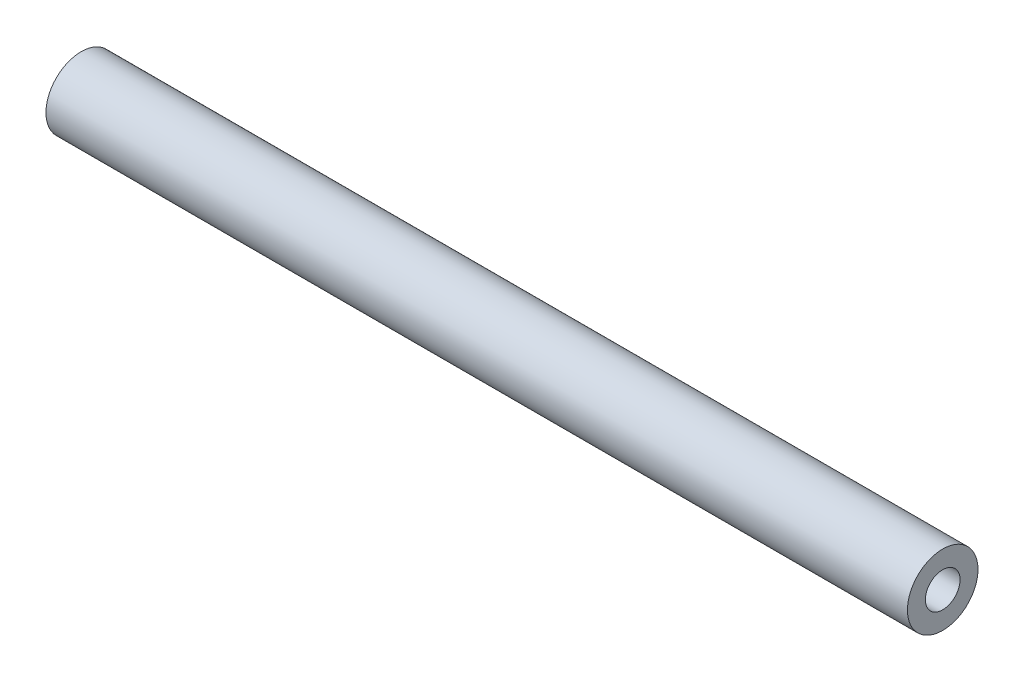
ISO-10303-21;
HEADER;
FILE_DESCRIPTION(('STEP AP214'),'2;1');
FILE_NAME('part.step','',(''),(''),'','','');
FILE_SCHEMA(('AUTOMOTIVE_DESIGN { 1 0 10303 214 1 1 1 1 }'));
ENDSEC;
DATA;
#1=APPLICATION_CONTEXT('core data for automotive mechanical design processes');
#2=APPLICATION_PROTOCOL_DEFINITION('international standard','automotive_design',2000,#1);
#3=PRODUCT_CONTEXT('',#1,'mechanical');
#4=PRODUCT('Part','Part','',(#3));
#5=PRODUCT_RELATED_PRODUCT_CATEGORY('part','',(#4));
#6=PRODUCT_DEFINITION_FORMATION('','',#4);
#7=PRODUCT_DEFINITION_CONTEXT('part definition',#1,'design');
#8=PRODUCT_DEFINITION('design','',#6,#7);
#9=PRODUCT_DEFINITION_SHAPE('','',#8);
#10=(LENGTH_UNIT() NAMED_UNIT(*) SI_UNIT(.MILLI.,.METRE.));
#11=(NAMED_UNIT(*) PLANE_ANGLE_UNIT() SI_UNIT($,.RADIAN.));
#12=(NAMED_UNIT(*) SI_UNIT($,.STERADIAN.) SOLID_ANGLE_UNIT());
#13=UNCERTAINTY_MEASURE_WITH_UNIT(LENGTH_MEASURE(1.E-05),#10,'distance_accuracy_value','');
#14=(GEOMETRIC_REPRESENTATION_CONTEXT(3) GLOBAL_UNCERTAINTY_ASSIGNED_CONTEXT((#13)) GLOBAL_UNIT_ASSIGNED_CONTEXT((#10,
#11,#12)) REPRESENTATION_CONTEXT('',''));
#15=CARTESIAN_POINT('',(0.,0.,0.));
#16=DIRECTION('',(0.,0.,1.));
#17=DIRECTION('',(1.,0.,0.));
#18=AXIS2_PLACEMENT_3D('',#15,#16,#17);
#19=CARTESIAN_POINT('',(155.,0.,0.));
#20=DIRECTION('',(1.,0.,0.));
#21=DIRECTION('',(0.,0.,-1.));
#22=AXIS2_PLACEMENT_3D('',#19,#20,#21);
#23=PLANE('',#22);
#24=CARTESIAN_POINT('',(155.,0.,0.));
#25=DIRECTION('',(1.,0.,0.));
#26=DIRECTION('',(0.,0.,-1.));
#27=AXIS2_PLACEMENT_3D('',#24,#25,#26);
#28=CIRCLE('',#27,6.35);
#29=CARTESIAN_POINT('',(155.,0.,-6.35));
#30=VERTEX_POINT('',#29);
#31=EDGE_CURVE('E10',#30,#30,#28,.T.);
#32=ORIENTED_EDGE('',*,*,#31,.T.);
#33=EDGE_LOOP('',(#32));
#34=FACE_BOUND('',#33,.T.);
#35=CARTESIAN_POINT('',(155.,0.,0.));
#36=DIRECTION('',(1.,0.,0.));
#37=DIRECTION('',(0.,0.,-1.));
#38=AXIS2_PLACEMENT_3D('',#35,#36,#37);
#39=CIRCLE('',#38,3.125);
#40=CARTESIAN_POINT('',(155.,0.,-3.125));
#41=VERTEX_POINT('',#40);
#42=EDGE_CURVE('E42',#41,#41,#39,.T.);
#43=ORIENTED_EDGE('',*,*,#42,.F.);
#44=EDGE_LOOP('',(#43));
#45=FACE_BOUND('',#44,.T.);
#46=ADVANCED_FACE('F31',(#34,#45),#23,.T.);
#47=CARTESIAN_POINT('',(0.,0.,0.));
#48=DIRECTION('',(1.,0.,0.));
#49=DIRECTION('',(0.,0.,-1.));
#50=AXIS2_PLACEMENT_3D('',#47,#48,#49);
#51=PLANE('',#50);
#52=CARTESIAN_POINT('',(0.,0.,0.));
#53=DIRECTION('',(1.,0.,0.));
#54=DIRECTION('',(0.,0.,-1.));
#55=AXIS2_PLACEMENT_3D('',#52,#53,#54);
#56=CIRCLE('',#55,6.35);
#57=CARTESIAN_POINT('',(0.,0.,-6.35));
#58=VERTEX_POINT('',#57);
#59=EDGE_CURVE('E35',#58,#58,#56,.T.);
#60=ORIENTED_EDGE('',*,*,#59,.F.);
#61=EDGE_LOOP('',(#60));
#62=FACE_BOUND('',#61,.T.);
#63=CARTESIAN_POINT('',(0.,0.,0.));
#64=DIRECTION('',(1.,0.,0.));
#65=DIRECTION('',(0.,0.,-1.));
#66=AXIS2_PLACEMENT_3D('',#63,#64,#65);
#67=CIRCLE('',#66,3.125);
#68=CARTESIAN_POINT('',(0.,0.,-3.125));
#69=VERTEX_POINT('',#68);
#70=EDGE_CURVE('E44',#69,#69,#67,.T.);
#71=ORIENTED_EDGE('',*,*,#70,.T.);
#72=EDGE_LOOP('',(#71));
#73=FACE_BOUND('',#72,.T.);
#74=ADVANCED_FACE('F54',(#62,#73),#51,.F.);
#75=CARTESIAN_POINT('',(155.,0.,0.));
#76=DIRECTION('',(-1.,0.,0.));
#77=DIRECTION('',(0.,0.,1.));
#78=AXIS2_PLACEMENT_3D('',#75,#76,#77);
#79=CYLINDRICAL_SURFACE('',#78,6.35);
#80=ORIENTED_EDGE('',*,*,#31,.F.);
#81=EDGE_LOOP('',(#80));
#82=FACE_BOUND('',#81,.T.);
#83=ORIENTED_EDGE('',*,*,#59,.T.);
#84=EDGE_LOOP('',(#83));
#85=FACE_BOUND('',#84,.T.);
#86=ADVANCED_FACE('F33',(#82,#85),#79,.T.);
#87=CARTESIAN_POINT('',(155.,0.,0.));
#88=DIRECTION('',(-1.,0.,0.));
#89=DIRECTION('',(0.,0.,1.));
#90=AXIS2_PLACEMENT_3D('',#87,#88,#89);
#91=CYLINDRICAL_SURFACE('',#90,3.125);
#92=ORIENTED_EDGE('',*,*,#42,.T.);
#93=EDGE_LOOP('',(#92));
#94=FACE_BOUND('',#93,.T.);
#95=ORIENTED_EDGE('',*,*,#70,.F.);
#96=EDGE_LOOP('',(#95));
#97=FACE_BOUND('',#96,.T.);
#98=ADVANCED_FACE('F50',(#94,#97),#91,.F.);
#99=CLOSED_SHELL('',(#46,#74,#86,#98));
#100=MANIFOLD_SOLID_BREP('B2',#99);
#101=ADVANCED_BREP_SHAPE_REPRESENTATION('',(#18,#100),#14);
#102=SHAPE_DEFINITION_REPRESENTATION(#9,#101);
ENDSEC;
END-ISO-10303-21;
